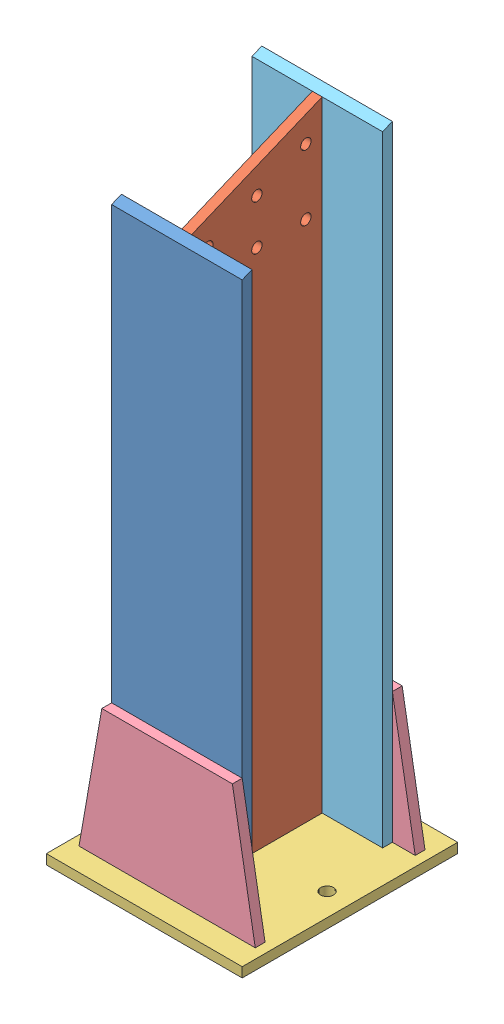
SolidWorks assembly poteau.SLDASM, configuration Défaut (file format 15000). Lengths in mm.
Overall size (300 971.2 330).
6 component instances, 5 part files, 16 mates.
Components (placement in the parent):
- plat petit-1: plat petit.SLDPRT [Défaut] at (-1021.6835 -117.6396 872.2137) x (-1 0 0) z (0 0 -1) size (200 867.16 15)
- plat sentrale-1: plat sentrale.SLDPRT [Défaut] at (-1014.1835 -76.2169 757.2137) x (0 0 1) z (-1 0 0) size (200 950 15)
- Platine-1: Platine.SLDPRT [Défaut] at (-1021.6835 -566.2169 757.2137) x (0 0 1) z (0 1 0) size (330 300 15)
- renfort-1: renfort.SLDPRT [Défaut] at (-1021.6835 -551.2169 627.2137) size (270 200 15)
- renfort-2: renfort.SLDPRT [Défaut] at (-1021.6835 -551.2169 872.2137) size (270 200 15)
- plat grand-2: plat grand.SLDPRT [Défaut] at (-1021.6835 -73.1169 657.2137) x (-1 0 0) z (0 0 -1) size (200 956.2 15)
Mates (geometry in assembly coordinates):
- Coïncidente4: coincident anti-aligned: plane of plat petit-1 through (-1021.6835 -117.6396 857.2137) normal (0 0 -1); plane of plat sentrale-1 through (-1029.1835 -551.2169 857.2137) normal (0 0 1)
- Coïncidente5: coincident anti-aligned: line of plat petit-1 through (-1121.6835 315.9404 857.2137) axis (1 0 0); line of plat sentrale-1 through (-1014.1835 315.9404 857.2137) axis (-1 0 0)
- Distance2: distance = 92.5 mm aligned: plane of plat petit-1 through (-1121.6835 -551.2196 857.2137) normal (-1 0 0); plane of plat sentrale-1 through (-1029.1835 -76.2169 757.2137) normal (-1 0 0)
- Coïncidente7: coincident anti-aligned: plane of plat sentrale-1 through (-1029.1835 -551.2169 857.2137) normal (0 -1 0); plane of Platine-1 through (-1021.6835 -551.2169 757.2137) normal (0 1 0)
- Distance3: distance = 142.5 mm aligned: plane of Platine-1 through (-1171.6835 -551.2169 592.2137) normal (-1 0 0); plane of plat sentrale-1 through (-1029.1835 -76.2169 757.2137) normal (-1 0 0)
- Distance4: distance = 50 mm aligned: plane of plat petit-1 through (-1021.6835 -117.6396 872.2137) normal (0 0 1); plane of Platine-1 through (-1171.6835 -551.2169 922.2137) normal (0 0 1)
- Coïncidente12: coincident anti-aligned: plane of Platine-1 through (-1021.6835 -551.2169 757.2137) normal (0 1 0); plane of renfort-1 through (-1156.6835 -551.2169 642.2137) normal (0 -1 0)
- Coïncidente14: coincident anti-aligned: plane of plat petit-1 through (-1021.6835 -117.6396 872.2137) normal (0 0 1); plane of renfort-2 through (-1021.6835 -551.2169 872.2137) normal (0 0 -1)
- Coïncidente15: coincident anti-aligned: plane of Platine-1 through (-1021.6835 -551.2169 757.2137) normal (0 1 0); plane of renfort-2 through (-1156.6835 -551.2169 887.2137) normal (0 -1 0)
- Coïncidente16: coincident: line of plat petit-1 through (-1121.6835 -551.2196 872.2137) axis (0 1 0); point of renfort-2
- Coïncidente17: coincident anti-aligned: plane of plat sentrale-1 through (-1029.1835 -551.2169 657.2137) normal (0 0 -1); plane of plat grand-2 through (-1021.6835 -73.1169 657.2137) normal (0 0 1)
- Coïncidente18: coincident anti-aligned: plane of Platine-1 through (-1021.6835 -551.2169 757.2137) normal (0 1 0); plane of plat grand-2 through (-921.6835 -551.2169 642.2137) normal (0 -1 0)
- Distance5: distance = 92.5 mm: line of plat grand-2 through (-1121.6835 -551.2169 657.2137) axis (0 1 0); line of plat sentrale-1 through (-1029.1835 398.7831 657.2137) axis (0 -1 0)
- Parallèle1: parallel anti-aligned: line of plat sentrale-1 through (-1029.1835 398.7831 657.2137) axis (1 0 0); line of plat grand-2 through (-921.6835 398.7699 657.2137) axis (-1 0 0)
- Coïncidente21: coincident anti-aligned: plane of renfort-1 through (-1021.6835 -551.2169 642.2137) normal (0 0 1); plane of plat grand-2 through (-1021.6835 -73.1169 642.2137) normal (0 0 -1)
- Coïncidente23: coincident aligned: line of renfort-1 through (-1156.6835 -551.2169 642.2137) axis (0 0 -1); line of renfort-2 through (-1156.6835 -551.2169 887.2137) axis (0 0 -1)
